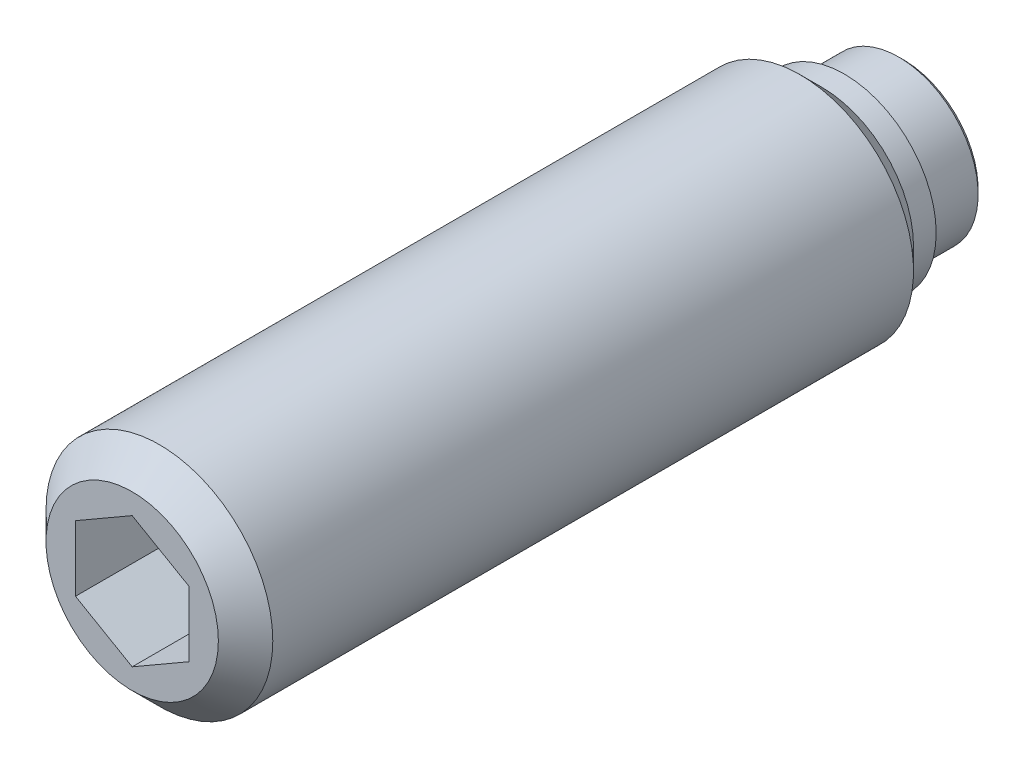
ISO-10303-21;
HEADER;
FILE_DESCRIPTION(('STEP AP214'),'2;1');
FILE_NAME('part.step','',(''),(''),'','','');
FILE_SCHEMA(('AUTOMOTIVE_DESIGN { 1 0 10303 214 1 1 1 1 }'));
ENDSEC;
DATA;
#1=APPLICATION_CONTEXT('core data for automotive mechanical design processes');
#2=APPLICATION_PROTOCOL_DEFINITION('international standard','automotive_design',2000,#1);
#3=PRODUCT_CONTEXT('',#1,'mechanical');
#4=PRODUCT('Part','Part','',(#3));
#5=PRODUCT_RELATED_PRODUCT_CATEGORY('part','',(#4));
#6=PRODUCT_DEFINITION_FORMATION('','',#4);
#7=PRODUCT_DEFINITION_CONTEXT('part definition',#1,'design');
#8=PRODUCT_DEFINITION('design','',#6,#7);
#9=PRODUCT_DEFINITION_SHAPE('','',#8);
#10=(LENGTH_UNIT() NAMED_UNIT(*) SI_UNIT(.MILLI.,.METRE.));
#11=(NAMED_UNIT(*) PLANE_ANGLE_UNIT() SI_UNIT($,.RADIAN.));
#12=(NAMED_UNIT(*) SI_UNIT($,.STERADIAN.) SOLID_ANGLE_UNIT());
#13=UNCERTAINTY_MEASURE_WITH_UNIT(LENGTH_MEASURE(1.E-05),#10,'distance_accuracy_value','');
#14=(GEOMETRIC_REPRESENTATION_CONTEXT(3) GLOBAL_UNCERTAINTY_ASSIGNED_CONTEXT((#13)) GLOBAL_UNIT_ASSIGNED_CONTEXT((#10,
#11,#12)) REPRESENTATION_CONTEXT('',''));
#15=CARTESIAN_POINT('',(0.,0.,0.));
#16=DIRECTION('',(0.,0.,1.));
#17=DIRECTION('',(1.,0.,0.));
#18=AXIS2_PLACEMENT_3D('',#15,#16,#17);
#19=CARTESIAN_POINT('',(0.,4.05,2.6));
#20=DIRECTION('',(0.,0.,1.));
#21=DIRECTION('',(1.,0.,0.));
#22=AXIS2_PLACEMENT_3D('',#19,#20,#21);
#23=PLANE('',#22);
#24=CARTESIAN_POINT('',(0.,0.,2.6));
#25=DIRECTION('',(0.,0.,-1.));
#26=DIRECTION('',(-1.,0.,0.));
#27=AXIS2_PLACEMENT_3D('',#24,#25,#26);
#28=CIRCLE('',#27,3.5);
#29=CARTESIAN_POINT('',(-3.5,0.,2.6));
#30=VERTEX_POINT('',#29);
#31=EDGE_CURVE('E130',#30,#30,#28,.T.);
#32=ORIENTED_EDGE('',*,*,#31,.F.);
#33=EDGE_LOOP('',(#32));
#34=FACE_BOUND('',#33,.T.);
#35=CARTESIAN_POINT('',(0.,0.,2.6));
#36=DIRECTION('',(0.,0.,-1.));
#37=DIRECTION('',(-1.,0.,0.));
#38=AXIS2_PLACEMENT_3D('',#35,#36,#37);
#39=CIRCLE('',#38,4.05);
#40=CARTESIAN_POINT('',(-4.05,0.,2.6));
#41=VERTEX_POINT('',#40);
#42=EDGE_CURVE('E133',#41,#41,#39,.T.);
#43=ORIENTED_EDGE('',*,*,#42,.T.);
#44=EDGE_LOOP('',(#43));
#45=FACE_BOUND('',#44,.T.);
#46=ADVANCED_FACE('F14',(#34,#45),#23,.F.);
#47=CARTESIAN_POINT('',(0.,0.,2.6));
#48=DIRECTION('',(0.,0.,-1.));
#49=DIRECTION('',(-1.,0.,0.));
#50=AXIS2_PLACEMENT_3D('',#47,#48,#49);
#51=CYLINDRICAL_SURFACE('',#50,5.);
#52=CARTESIAN_POINT('',(0.,0.,32.8));
#53=DIRECTION('',(0.,0.,1.));
#54=DIRECTION('',(1.,0.,0.));
#55=AXIS2_PLACEMENT_3D('',#52,#53,#54);
#56=CIRCLE('',#55,5.);
#57=CARTESIAN_POINT('',(5.,0.,32.8));
#58=VERTEX_POINT('',#57);
#59=EDGE_CURVE('E9',#58,#58,#56,.F.);
#60=ORIENTED_EDGE('',*,*,#59,.T.);
#61=EDGE_LOOP('',(#60));
#62=FACE_BOUND('',#61,.T.);
#63=CARTESIAN_POINT('',(0.,0.,4.55));
#64=DIRECTION('',(0.,0.,-1.));
#65=DIRECTION('',(-1.,0.,0.));
#66=AXIS2_PLACEMENT_3D('',#63,#64,#65);
#67=CIRCLE('',#66,5.);
#68=CARTESIAN_POINT('',(-5.,0.,4.55));
#69=VERTEX_POINT('',#68);
#70=EDGE_CURVE('E139',#69,#69,#67,.T.);
#71=ORIENTED_EDGE('',*,*,#70,.F.);
#72=EDGE_LOOP('',(#71));
#73=FACE_BOUND('',#72,.T.);
#74=ADVANCED_FACE('F157',(#62,#73),#51,.T.);
#75=CARTESIAN_POINT('',(0.,0.,4.55));
#76=DIRECTION('',(0.,0.,1.));
#77=DIRECTION('',(1.,0.,0.));
#78=AXIS2_PLACEMENT_3D('',#75,#76,#77);
#79=CONICAL_SURFACE('',#78,5.,0.785398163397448);
#80=CARTESIAN_POINT('',(0.,0.,3.6));
#81=DIRECTION('',(0.,0.,-1.));
#82=DIRECTION('',(-1.,0.,0.));
#83=AXIS2_PLACEMENT_3D('',#80,#81,#82);
#84=CIRCLE('',#83,4.05);
#85=CARTESIAN_POINT('',(-4.05,0.,3.6));
#86=VERTEX_POINT('',#85);
#87=EDGE_CURVE('E136',#86,#86,#84,.T.);
#88=ORIENTED_EDGE('',*,*,#87,.F.);
#89=EDGE_LOOP('',(#88));
#90=FACE_BOUND('',#89,.T.);
#91=ORIENTED_EDGE('',*,*,#70,.T.);
#92=EDGE_LOOP('',(#91));
#93=FACE_BOUND('',#92,.T.);
#94=ADVANCED_FACE('F164',(#90,#93),#79,.T.);
#95=CARTESIAN_POINT('',(0.,0.,2.6));
#96=DIRECTION('',(0.,0.,-1.));
#97=DIRECTION('',(-1.,0.,0.));
#98=AXIS2_PLACEMENT_3D('',#95,#96,#97);
#99=CYLINDRICAL_SURFACE('',#98,4.05);
#100=ORIENTED_EDGE('',*,*,#42,.F.);
#101=EDGE_LOOP('',(#100));
#102=FACE_BOUND('',#101,.T.);
#103=ORIENTED_EDGE('',*,*,#87,.T.);
#104=EDGE_LOOP('',(#103));
#105=FACE_BOUND('',#104,.T.);
#106=ADVANCED_FACE('F172',(#102,#105),#99,.T.);
#107=CARTESIAN_POINT('',(0.,0.,-1.5));
#108=DIRECTION('',(0.,0.,-1.));
#109=DIRECTION('',(-1.,0.,0.));
#110=AXIS2_PLACEMENT_3D('',#107,#108,#109);
#111=CYLINDRICAL_SURFACE('',#110,3.5);
#112=CARTESIAN_POINT('',(0.,0.,0.2));
#113=DIRECTION('',(0.,0.,-1.));
#114=DIRECTION('',(-1.,0.,0.));
#115=AXIS2_PLACEMENT_3D('',#112,#113,#114);
#116=CIRCLE('',#115,3.5);
#117=CARTESIAN_POINT('',(-3.5,0.,0.2));
#118=VERTEX_POINT('',#117);
#119=EDGE_CURVE('E127',#118,#118,#116,.T.);
#120=ORIENTED_EDGE('',*,*,#119,.F.);
#121=EDGE_LOOP('',(#120));
#122=FACE_BOUND('',#121,.T.);
#123=ORIENTED_EDGE('',*,*,#31,.T.);
#124=EDGE_LOOP('',(#123));
#125=FACE_BOUND('',#124,.T.);
#126=ADVANCED_FACE('F170',(#122,#125),#111,.T.);
#127=CARTESIAN_POINT('',(0.,0.,0.2));
#128=DIRECTION('',(0.,0.,1.));
#129=DIRECTION('',(1.,0.,0.));
#130=AXIS2_PLACEMENT_3D('',#127,#128,#129);
#131=CONICAL_SURFACE('',#130,3.5,0.785398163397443);
#132=CARTESIAN_POINT('',(0.,0.,0.));
#133=DIRECTION('',(0.,0.,-1.));
#134=DIRECTION('',(-1.,0.,0.));
#135=AXIS2_PLACEMENT_3D('',#132,#133,#134);
#136=CIRCLE('',#135,3.3);
#137=CARTESIAN_POINT('',(-3.3,0.,0.));
#138=VERTEX_POINT('',#137);
#139=EDGE_CURVE('E124',#138,#138,#136,.T.);
#140=ORIENTED_EDGE('',*,*,#139,.F.);
#141=EDGE_LOOP('',(#140));
#142=FACE_BOUND('',#141,.T.);
#143=ORIENTED_EDGE('',*,*,#119,.T.);
#144=EDGE_LOOP('',(#143));
#145=FACE_BOUND('',#144,.T.);
#146=ADVANCED_FACE('F204',(#142,#145),#131,.T.);
#147=CARTESIAN_POINT('',(0.,3.3,0.));
#148=DIRECTION('',(0.,0.,1.));
#149=DIRECTION('',(1.,0.,0.));
#150=AXIS2_PLACEMENT_3D('',#147,#148,#149);
#151=PLANE('',#150);
#152=CARTESIAN_POINT('',(0.,0.,0.));
#153=DIRECTION('',(0.,0.,-1.));
#154=DIRECTION('',(-1.,0.,0.));
#155=AXIS2_PLACEMENT_3D('',#152,#153,#154);
#156=CIRCLE('',#155,1.5);
#157=CARTESIAN_POINT('',(-1.5,0.,0.));
#158=VERTEX_POINT('',#157);
#159=EDGE_CURVE('E114',#158,#158,#156,.T.);
#160=ORIENTED_EDGE('',*,*,#159,.F.);
#161=EDGE_LOOP('',(#160));
#162=FACE_BOUND('',#161,.T.);
#163=ORIENTED_EDGE('',*,*,#139,.T.);
#164=EDGE_LOOP('',(#163));
#165=FACE_BOUND('',#164,.T.);
#166=ADVANCED_FACE('F212',(#162,#165),#151,.F.);
#167=CARTESIAN_POINT('',(0.,0.,0.));
#168=DIRECTION('',(0.,0.,1.));
#169=DIRECTION('',(1.,0.,0.));
#170=AXIS2_PLACEMENT_3D('',#167,#168,#169);
#171=CONICAL_SURFACE('',#170,1.5,0.785398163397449);
#172=CARTESIAN_POINT('',(0.,0.,-1.5));
#173=VERTEX_POINT('',#172);
#174=VERTEX_LOOP('',#173);
#175=FACE_BOUND('',#174,.T.);
#176=ORIENTED_EDGE('',*,*,#159,.T.);
#177=EDGE_LOOP('',(#176));
#178=FACE_BOUND('',#177,.T.);
#179=ADVANCED_FACE('F220',(#175,#178),#171,.T.);
#180=CARTESIAN_POINT('',(0.,0.,34.));
#181=DIRECTION('',(0.,0.,1.));
#182=DIRECTION('',(1.,0.,0.));
#183=AXIS2_PLACEMENT_3D('',#180,#181,#182);
#184=PLANE('',#183);
#185=CARTESIAN_POINT('',(0.,0.,34.));
#186=DIRECTION('',(0.,0.,1.));
#187=DIRECTION('',(1.,0.,0.));
#188=AXIS2_PLACEMENT_3D('',#185,#186,#187);
#189=CIRCLE('',#188,3.8);
#190=CARTESIAN_POINT('',(3.8,0.,34.));
#191=VERTEX_POINT('',#190);
#192=EDGE_CURVE('E22',#191,#191,#189,.T.);
#193=ORIENTED_EDGE('',*,*,#192,.T.);
#194=EDGE_LOOP('',(#193));
#195=FACE_BOUND('',#194,.T.);
#196=DIRECTION('',(-0.866025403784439,0.5,0.));
#197=VECTOR('',#196,1.);
#198=CARTESIAN_POINT('',(2.5,1.44337567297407,34.));
#199=LINE('',#198,#197);
#200=CARTESIAN_POINT('',(2.5,1.44337567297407,34.));
#201=VERTEX_POINT('',#200);
#202=CARTESIAN_POINT('',(0.,2.88675134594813,34.));
#203=VERTEX_POINT('',#202);
#204=EDGE_CURVE('E29',#201,#203,#199,.T.);
#205=ORIENTED_EDGE('',*,*,#204,.F.);
#206=DIRECTION('',(0.,1.,0.));
#207=VECTOR('',#206,1.);
#208=CARTESIAN_POINT('',(2.5,-1.44337567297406,34.));
#209=LINE('',#208,#207);
#210=CARTESIAN_POINT('',(2.5,-1.44337567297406,34.));
#211=VERTEX_POINT('',#210);
#212=EDGE_CURVE('E88',#211,#201,#209,.T.);
#213=ORIENTED_EDGE('',*,*,#212,.F.);
#214=DIRECTION('',(0.866025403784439,0.5,0.));
#215=VECTOR('',#214,1.);
#216=CARTESIAN_POINT('',(0.,-2.88675134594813,34.));
#217=LINE('',#216,#215);
#218=CARTESIAN_POINT('',(0.,-2.88675134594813,34.));
#219=VERTEX_POINT('',#218);
#220=EDGE_CURVE('E91',#219,#211,#217,.T.);
#221=ORIENTED_EDGE('',*,*,#220,.F.);
#222=DIRECTION('',(0.866025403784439,-0.5,0.));
#223=VECTOR('',#222,1.);
#224=CARTESIAN_POINT('',(-2.5,-1.44337567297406,34.));
#225=LINE('',#224,#223);
#226=CARTESIAN_POINT('',(-2.5,-1.44337567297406,34.));
#227=VERTEX_POINT('',#226);
#228=EDGE_CURVE('E107',#227,#219,#225,.T.);
#229=ORIENTED_EDGE('',*,*,#228,.F.);
#230=DIRECTION('',(0.,-1.,0.));
#231=VECTOR('',#230,1.);
#232=CARTESIAN_POINT('',(-2.5,1.44337567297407,34.));
#233=LINE('',#232,#231);
#234=CARTESIAN_POINT('',(-2.5,1.44337567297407,34.));
#235=VERTEX_POINT('',#234);
#236=EDGE_CURVE('E104',#235,#227,#233,.T.);
#237=ORIENTED_EDGE('',*,*,#236,.F.);
#238=DIRECTION('',(-0.866025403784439,-0.5,0.));
#239=VECTOR('',#238,1.);
#240=CARTESIAN_POINT('',(0.,2.88675134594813,34.));
#241=LINE('',#240,#239);
#242=EDGE_CURVE('E102',#203,#235,#241,.T.);
#243=ORIENTED_EDGE('',*,*,#242,.F.);
#244=EDGE_LOOP('',(#205,#213,#221,#229,#237,#243));
#245=FACE_BOUND('',#244,.T.);
#246=ADVANCED_FACE('F144',(#195,#245),#184,.T.);
#247=CARTESIAN_POINT('',(2.5,1.44337567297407,28.));
#248=DIRECTION('',(0.5,0.866025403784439,0.));
#249=DIRECTION('',(-0.866025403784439,0.5,0.));
#250=AXIS2_PLACEMENT_3D('',#247,#248,#249);
#251=PLANE('',#250);
#252=ORIENTED_EDGE('',*,*,#204,.T.);
#253=DIRECTION('',(0.,0.,1.));
#254=VECTOR('',#253,1.);
#255=CARTESIAN_POINT('',(0.,2.88675134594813,28.));
#256=LINE('',#255,#254);
#257=CARTESIAN_POINT('',(0.,2.88675134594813,28.));
#258=VERTEX_POINT('',#257);
#259=EDGE_CURVE('E65',#258,#203,#256,.T.);
#260=ORIENTED_EDGE('',*,*,#259,.F.);
#261=DIRECTION('',(-0.866025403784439,0.5,0.));
#262=VECTOR('',#261,1.);
#263=CARTESIAN_POINT('',(2.5,1.44337567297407,28.));
#264=LINE('',#263,#262);
#265=CARTESIAN_POINT('',(2.5,1.44337567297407,28.));
#266=VERTEX_POINT('',#265);
#267=EDGE_CURVE('E69',#266,#258,#264,.T.);
#268=ORIENTED_EDGE('',*,*,#267,.F.);
#269=DIRECTION('',(0.,0.,1.));
#270=VECTOR('',#269,1.);
#271=CARTESIAN_POINT('',(2.5,1.44337567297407,28.));
#272=LINE('',#271,#270);
#273=EDGE_CURVE('E112',#266,#201,#272,.T.);
#274=ORIENTED_EDGE('',*,*,#273,.T.);
#275=EDGE_LOOP('',(#252,#260,#268,#274));
#276=FACE_BOUND('',#275,.T.);
#277=ADVANCED_FACE('F67',(#276),#251,.F.);
#278=CARTESIAN_POINT('',(2.5,-1.44337567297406,28.));
#279=DIRECTION('',(1.,0.,0.));
#280=DIRECTION('',(0.,0.,-1.));
#281=AXIS2_PLACEMENT_3D('',#278,#279,#280);
#282=PLANE('',#281);
#283=ORIENTED_EDGE('',*,*,#212,.T.);
#284=ORIENTED_EDGE('',*,*,#273,.F.);
#285=DIRECTION('',(0.,1.,0.));
#286=VECTOR('',#285,1.);
#287=CARTESIAN_POINT('',(2.5,-1.44337567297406,28.));
#288=LINE('',#287,#286);
#289=CARTESIAN_POINT('',(2.5,-1.44337567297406,28.));
#290=VERTEX_POINT('',#289);
#291=EDGE_CURVE('E75',#290,#266,#288,.T.);
#292=ORIENTED_EDGE('',*,*,#291,.F.);
#293=DIRECTION('',(0.,0.,1.));
#294=VECTOR('',#293,1.);
#295=CARTESIAN_POINT('',(2.5,-1.44337567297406,28.));
#296=LINE('',#295,#294);
#297=EDGE_CURVE('E115',#290,#211,#296,.T.);
#298=ORIENTED_EDGE('',*,*,#297,.T.);
#299=EDGE_LOOP('',(#283,#284,#292,#298));
#300=FACE_BOUND('',#299,.T.);
#301=ADVANCED_FACE('F243',(#300),#282,.F.);
#302=CARTESIAN_POINT('',(0.,-2.88675134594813,28.));
#303=DIRECTION('',(0.5,-0.866025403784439,0.));
#304=DIRECTION('',(0.866025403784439,0.5,0.));
#305=AXIS2_PLACEMENT_3D('',#302,#303,#304);
#306=PLANE('',#305);
#307=ORIENTED_EDGE('',*,*,#220,.T.);
#308=ORIENTED_EDGE('',*,*,#297,.F.);
#309=DIRECTION('',(0.866025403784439,0.5,0.));
#310=VECTOR('',#309,1.);
#311=CARTESIAN_POINT('',(0.,-2.88675134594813,28.));
#312=LINE('',#311,#310);
#313=CARTESIAN_POINT('',(0.,-2.88675134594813,28.));
#314=VERTEX_POINT('',#313);
#315=EDGE_CURVE('E98',#314,#290,#312,.T.);
#316=ORIENTED_EDGE('',*,*,#315,.F.);
#317=DIRECTION('',(0.,0.,1.));
#318=VECTOR('',#317,1.);
#319=CARTESIAN_POINT('',(0.,-2.88675134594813,28.));
#320=LINE('',#319,#318);
#321=EDGE_CURVE('E117',#314,#219,#320,.T.);
#322=ORIENTED_EDGE('',*,*,#321,.T.);
#323=EDGE_LOOP('',(#307,#308,#316,#322));
#324=FACE_BOUND('',#323,.T.);
#325=ADVANCED_FACE('F251',(#324),#306,.F.);
#326=CARTESIAN_POINT('',(-2.5,-1.44337567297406,28.));
#327=DIRECTION('',(-0.5,-0.866025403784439,0.));
#328=DIRECTION('',(0.866025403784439,-0.5,0.));
#329=AXIS2_PLACEMENT_3D('',#326,#327,#328);
#330=PLANE('',#329);
#331=ORIENTED_EDGE('',*,*,#228,.T.);
#332=ORIENTED_EDGE('',*,*,#321,.F.);
#333=DIRECTION('',(0.866025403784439,-0.5,0.));
#334=VECTOR('',#333,1.);
#335=CARTESIAN_POINT('',(-2.5,-1.44337567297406,28.));
#336=LINE('',#335,#334);
#337=CARTESIAN_POINT('',(-2.5,-1.44337567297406,28.));
#338=VERTEX_POINT('',#337);
#339=EDGE_CURVE('E95',#338,#314,#336,.T.);
#340=ORIENTED_EDGE('',*,*,#339,.F.);
#341=DIRECTION('',(0.,0.,1.));
#342=VECTOR('',#341,1.);
#343=CARTESIAN_POINT('',(-2.5,-1.44337567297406,28.));
#344=LINE('',#343,#342);
#345=EDGE_CURVE('E119',#338,#227,#344,.T.);
#346=ORIENTED_EDGE('',*,*,#345,.T.);
#347=EDGE_LOOP('',(#331,#332,#340,#346));
#348=FACE_BOUND('',#347,.T.);
#349=ADVANCED_FACE('F260',(#348),#330,.F.);
#350=CARTESIAN_POINT('',(-2.5,1.44337567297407,28.));
#351=DIRECTION('',(-1.,0.,0.));
#352=DIRECTION('',(0.,-1.,0.));
#353=AXIS2_PLACEMENT_3D('',#350,#351,#352);
#354=PLANE('',#353);
#355=ORIENTED_EDGE('',*,*,#236,.T.);
#356=ORIENTED_EDGE('',*,*,#345,.F.);
#357=DIRECTION('',(0.,-1.,0.));
#358=VECTOR('',#357,1.);
#359=CARTESIAN_POINT('',(-2.5,1.44337567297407,28.));
#360=LINE('',#359,#358);
#361=CARTESIAN_POINT('',(-2.5,1.44337567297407,28.));
#362=VERTEX_POINT('',#361);
#363=EDGE_CURVE('E83',#362,#338,#360,.T.);
#364=ORIENTED_EDGE('',*,*,#363,.F.);
#365=DIRECTION('',(0.,0.,1.));
#366=VECTOR('',#365,1.);
#367=CARTESIAN_POINT('',(-2.5,1.44337567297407,28.));
#368=LINE('',#367,#366);
#369=EDGE_CURVE('E74',#362,#235,#368,.T.);
#370=ORIENTED_EDGE('',*,*,#369,.T.);
#371=EDGE_LOOP('',(#355,#356,#364,#370));
#372=FACE_BOUND('',#371,.T.);
#373=ADVANCED_FACE('F269',(#372),#354,.F.);
#374=CARTESIAN_POINT('',(0.,2.88675134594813,28.));
#375=DIRECTION('',(-0.5,0.866025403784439,0.));
#376=DIRECTION('',(-0.866025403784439,-0.5,0.));
#377=AXIS2_PLACEMENT_3D('',#374,#375,#376);
#378=PLANE('',#377);
#379=ORIENTED_EDGE('',*,*,#242,.T.);
#380=ORIENTED_EDGE('',*,*,#369,.F.);
#381=DIRECTION('',(-0.866025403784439,-0.5,0.));
#382=VECTOR('',#381,1.);
#383=CARTESIAN_POINT('',(0.,2.88675134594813,28.));
#384=LINE('',#383,#382);
#385=EDGE_CURVE('E78',#258,#362,#384,.T.);
#386=ORIENTED_EDGE('',*,*,#385,.F.);
#387=ORIENTED_EDGE('',*,*,#259,.T.);
#388=EDGE_LOOP('',(#379,#380,#386,#387));
#389=FACE_BOUND('',#388,.T.);
#390=ADVANCED_FACE('F79',(#389),#378,.F.);
#391=CARTESIAN_POINT('',(0.,0.,28.));
#392=DIRECTION('',(0.,0.,1.));
#393=DIRECTION('',(1.,0.,0.));
#394=AXIS2_PLACEMENT_3D('',#391,#392,#393);
#395=PLANE('',#394);
#396=ORIENTED_EDGE('',*,*,#267,.T.);
#397=ORIENTED_EDGE('',*,*,#385,.T.);
#398=ORIENTED_EDGE('',*,*,#363,.T.);
#399=ORIENTED_EDGE('',*,*,#339,.T.);
#400=ORIENTED_EDGE('',*,*,#315,.T.);
#401=ORIENTED_EDGE('',*,*,#291,.T.);
#402=EDGE_LOOP('',(#396,#397,#398,#399,#400,#401));
#403=FACE_BOUND('',#402,.T.);
#404=ADVANCED_FACE('F85',(#403),#395,.T.);
#405=CARTESIAN_POINT('',(0.,0.,34.));
#406=DIRECTION('',(0.,0.,-1.));
#407=DIRECTION('',(-1.,0.,0.));
#408=AXIS2_PLACEMENT_3D('',#405,#406,#407);
#409=CONICAL_SURFACE('',#408,3.8,0.785398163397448);
#410=ORIENTED_EDGE('',*,*,#59,.F.);
#411=EDGE_LOOP('',(#410));
#412=FACE_BOUND('',#411,.T.);
#413=ORIENTED_EDGE('',*,*,#192,.F.);
#414=EDGE_LOOP('',(#413));
#415=FACE_BOUND('',#414,.T.);
#416=ADVANCED_FACE('F16',(#412,#415),#409,.T.);
#417=CLOSED_SHELL('',(#46,#74,#94,#106,#126,#146,#166,#179,#246,#277,#301,#325,#349,#373,#390,
#404,#416));
#418=MANIFOLD_SOLID_BREP('B1',#417);
#419=ADVANCED_BREP_SHAPE_REPRESENTATION('',(#18,#418),#14);
#420=SHAPE_DEFINITION_REPRESENTATION(#9,#419);
ENDSEC;
END-ISO-10303-21;
